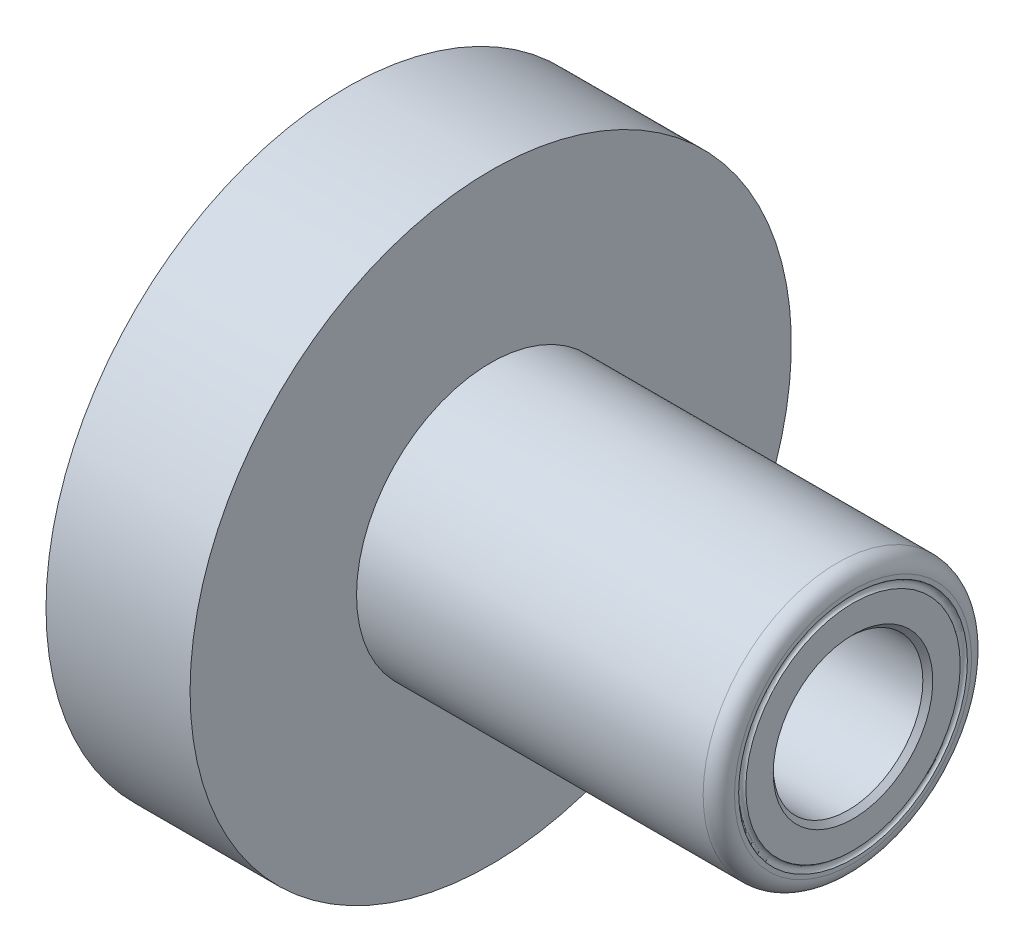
ISO-10303-21;
HEADER;
FILE_DESCRIPTION(('STEP AP214'),'2;1');
FILE_NAME('part.step','',(''),(''),'','','');
FILE_SCHEMA(('AUTOMOTIVE_DESIGN { 1 0 10303 214 1 1 1 1 }'));
ENDSEC;
DATA;
#1=APPLICATION_CONTEXT('core data for automotive mechanical design processes');
#2=APPLICATION_PROTOCOL_DEFINITION('international standard','automotive_design',2000,#1);
#3=PRODUCT_CONTEXT('',#1,'mechanical');
#4=PRODUCT('Part','Part','',(#3));
#5=PRODUCT_RELATED_PRODUCT_CATEGORY('part','',(#4));
#6=PRODUCT_DEFINITION_FORMATION('','',#4);
#7=PRODUCT_DEFINITION_CONTEXT('part definition',#1,'design');
#8=PRODUCT_DEFINITION('design','',#6,#7);
#9=PRODUCT_DEFINITION_SHAPE('','',#8);
#10=(LENGTH_UNIT() NAMED_UNIT(*) SI_UNIT(.MILLI.,.METRE.));
#11=(NAMED_UNIT(*) PLANE_ANGLE_UNIT() SI_UNIT($,.RADIAN.));
#12=(NAMED_UNIT(*) SI_UNIT($,.STERADIAN.) SOLID_ANGLE_UNIT());
#13=UNCERTAINTY_MEASURE_WITH_UNIT(LENGTH_MEASURE(1.E-05),#10,'distance_accuracy_value','');
#14=(GEOMETRIC_REPRESENTATION_CONTEXT(3) GLOBAL_UNCERTAINTY_ASSIGNED_CONTEXT((#13)) GLOBAL_UNIT_ASSIGNED_CONTEXT((#10,
#11,#12)) REPRESENTATION_CONTEXT('',''));
#15=CARTESIAN_POINT('',(0.,0.,0.));
#16=DIRECTION('',(0.,0.,1.));
#17=DIRECTION('',(1.,0.,0.));
#18=AXIS2_PLACEMENT_3D('',#15,#16,#17);
#19=CARTESIAN_POINT('',(50.8,11.8872,0.));
#20=DIRECTION('',(-1.,0.,0.));
#21=DIRECTION('',(0.,0.,1.));
#22=AXIS2_PLACEMENT_3D('',#19,#20,#21);
#23=PLANE('',#22);
#24=CARTESIAN_POINT('',(50.8,0.,0.));
#25=DIRECTION('',(-1.,0.,0.));
#26=DIRECTION('',(0.,0.,1.));
#27=AXIS2_PLACEMENT_3D('',#24,#25,#26);
#28=CIRCLE('',#27,11.8872);
#29=CARTESIAN_POINT('',(50.8,0.,11.8872));
#30=VERTEX_POINT('',#29);
#31=EDGE_CURVE('E87',#30,#30,#28,.T.);
#32=ORIENTED_EDGE('',*,*,#31,.F.);
#33=EDGE_LOOP('',(#32));
#34=FACE_BOUND('',#33,.T.);
#35=CARTESIAN_POINT('',(50.8,0.,0.));
#36=DIRECTION('',(-1.,0.,0.));
#37=DIRECTION('',(0.,0.,1.));
#38=AXIS2_PLACEMENT_3D('',#35,#36,#37);
#39=CIRCLE('',#38,11.4742102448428);
#40=CARTESIAN_POINT('',(50.8,0.,11.4742102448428));
#41=VERTEX_POINT('',#40);
#42=EDGE_CURVE('E35',#41,#41,#39,.F.);
#43=ORIENTED_EDGE('',*,*,#42,.F.);
#44=EDGE_LOOP('',(#43));
#45=FACE_BOUND('',#44,.T.);
#46=ADVANCED_FACE('F31',(#34,#45),#23,.F.);
#47=CARTESIAN_POINT('',(50.8,0.,0.));
#48=DIRECTION('',(-1.,0.,0.));
#49=DIRECTION('',(0.,0.,1.));
#50=AXIS2_PLACEMENT_3D('',#47,#48,#49);
#51=CIRCLE('',#50,8.00500000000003);
#52=CARTESIAN_POINT('',(50.8,0.,8.00500000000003));
#53=VERTEX_POINT('',#52);
#54=EDGE_CURVE('E10',#53,#53,#51,.T.);
#55=ORIENTED_EDGE('',*,*,#54,.T.);
#56=EDGE_LOOP('',(#55));
#57=FACE_BOUND('',#56,.T.);
#58=CARTESIAN_POINT('',(50.8,0.,0.));
#59=DIRECTION('',(1.,0.,0.));
#60=DIRECTION('',(0.,0.,-1.));
#61=AXIS2_PLACEMENT_3D('',#58,#59,#60);
#62=CIRCLE('',#61,10.7557897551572);
#63=CARTESIAN_POINT('',(50.8,0.,-10.7557897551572));
#64=VERTEX_POINT('',#63);
#65=EDGE_CURVE('E47',#64,#64,#62,.F.);
#66=ORIENTED_EDGE('',*,*,#65,.F.);
#67=EDGE_LOOP('',(#66));
#68=FACE_BOUND('',#67,.T.);
#69=ADVANCED_FACE('F97',(#57,#68),#23,.F.);
#70=CARTESIAN_POINT('',(0.,0.,0.));
#71=DIRECTION('',(-1.,0.,0.));
#72=DIRECTION('',(0.,0.,1.));
#73=AXIS2_PLACEMENT_3D('',#70,#71,#72);
#74=CYLINDRICAL_SURFACE('',#73,9.906);
#75=CARTESIAN_POINT('',(30.9372,0.,0.));
#76=DIRECTION('',(-1.,0.,0.));
#77=DIRECTION('',(0.,0.,1.));
#78=AXIS2_PLACEMENT_3D('',#75,#76,#77);
#79=CIRCLE('',#78,9.906);
#80=CARTESIAN_POINT('',(30.9372,0.,9.906));
#81=VERTEX_POINT('',#80);
#82=EDGE_CURVE('E44',#81,#81,#79,.T.);
#83=ORIENTED_EDGE('',*,*,#82,.F.);
#84=EDGE_LOOP('',(#83));
#85=FACE_BOUND('',#84,.T.);
#86=CARTESIAN_POINT('',(0.,0.,0.));
#87=DIRECTION('',(-1.,0.,0.));
#88=DIRECTION('',(0.,0.,1.));
#89=AXIS2_PLACEMENT_3D('',#86,#87,#88);
#90=CIRCLE('',#89,9.906);
#91=CARTESIAN_POINT('',(0.,0.,9.906));
#92=VERTEX_POINT('',#91);
#93=EDGE_CURVE('E70',#92,#92,#90,.T.);
#94=ORIENTED_EDGE('',*,*,#93,.T.);
#95=EDGE_LOOP('',(#94));
#96=FACE_BOUND('',#95,.T.);
#97=ADVANCED_FACE('F94',(#85,#96),#74,.F.);
#98=CARTESIAN_POINT('',(30.9372,9.906,0.));
#99=DIRECTION('',(1.,0.,0.));
#100=DIRECTION('',(0.,0.,-1.));
#101=AXIS2_PLACEMENT_3D('',#98,#99,#100);
#102=PLANE('',#101);
#103=CARTESIAN_POINT('',(30.9372,0.,0.));
#104=DIRECTION('',(1.,0.,0.));
#105=DIRECTION('',(0.,0.,-1.));
#106=AXIS2_PLACEMENT_3D('',#103,#104,#105);
#107=CIRCLE('',#106,7.505);
#108=CARTESIAN_POINT('',(30.9372,0.,-7.505));
#109=VERTEX_POINT('',#108);
#110=EDGE_CURVE('E52',#109,#109,#107,.T.);
#111=ORIENTED_EDGE('',*,*,#110,.T.);
#112=EDGE_LOOP('',(#111));
#113=FACE_BOUND('',#112,.T.);
#114=ORIENTED_EDGE('',*,*,#82,.T.);
#115=EDGE_LOOP('',(#114));
#116=FACE_BOUND('',#115,.T.);
#117=ADVANCED_FACE('F92',(#113,#116),#102,.F.);
#118=CARTESIAN_POINT('',(49.2252,0.,0.));
#119=DIRECTION('',(-1.,0.,0.));
#120=DIRECTION('',(0.,0.,1.));
#121=AXIS2_PLACEMENT_3D('',#118,#119,#120);
#122=TOROIDAL_SURFACE('',#121,11.8872,1.5748);
#123=CARTESIAN_POINT('',(49.2252,0.,0.));
#124=DIRECTION('',(-1.,0.,0.));
#125=DIRECTION('',(0.,0.,1.));
#126=AXIS2_PLACEMENT_3D('',#123,#124,#125);
#127=CIRCLE('',#126,13.462);
#128=CARTESIAN_POINT('',(49.2252,0.,13.462));
#129=VERTEX_POINT('',#128);
#130=EDGE_CURVE('E84',#129,#129,#127,.T.);
#131=ORIENTED_EDGE('',*,*,#130,.F.);
#132=EDGE_LOOP('',(#131));
#133=FACE_BOUND('',#132,.T.);
#134=ORIENTED_EDGE('',*,*,#31,.T.);
#135=EDGE_LOOP('',(#134));
#136=FACE_BOUND('',#135,.T.);
#137=ADVANCED_FACE('F123',(#133,#136),#122,.T.);
#138=CARTESIAN_POINT('',(0.,0.,0.));
#139=DIRECTION('',(-1.,0.,0.));
#140=DIRECTION('',(0.,0.,1.));
#141=AXIS2_PLACEMENT_3D('',#138,#139,#140);
#142=CYLINDRICAL_SURFACE('',#141,13.462);
#143=CARTESIAN_POINT('',(14.4526,0.,0.));
#144=DIRECTION('',(-1.,0.,0.));
#145=DIRECTION('',(0.,0.,1.));
#146=AXIS2_PLACEMENT_3D('',#143,#144,#145);
#147=CIRCLE('',#146,13.462);
#148=CARTESIAN_POINT('',(14.4526,0.,13.462));
#149=VERTEX_POINT('',#148);
#150=EDGE_CURVE('E81',#149,#149,#147,.T.);
#151=ORIENTED_EDGE('',*,*,#150,.F.);
#152=EDGE_LOOP('',(#151));
#153=FACE_BOUND('',#152,.T.);
#154=ORIENTED_EDGE('',*,*,#130,.T.);
#155=EDGE_LOOP('',(#154));
#156=FACE_BOUND('',#155,.T.);
#157=ADVANCED_FACE('F117',(#153,#156),#142,.T.);
#158=CARTESIAN_POINT('',(14.4526,30.1625,0.));
#159=DIRECTION('',(-1.,0.,0.));
#160=DIRECTION('',(0.,0.,1.));
#161=AXIS2_PLACEMENT_3D('',#158,#159,#160);
#162=PLANE('',#161);
#163=CARTESIAN_POINT('',(14.4526,0.,0.));
#164=DIRECTION('',(-1.,0.,0.));
#165=DIRECTION('',(0.,0.,1.));
#166=AXIS2_PLACEMENT_3D('',#163,#164,#165);
#167=CIRCLE('',#166,30.1625);
#168=CARTESIAN_POINT('',(14.4526,0.,30.1625));
#169=VERTEX_POINT('',#168);
#170=EDGE_CURVE('E78',#169,#169,#167,.T.);
#171=ORIENTED_EDGE('',*,*,#170,.F.);
#172=EDGE_LOOP('',(#171));
#173=FACE_BOUND('',#172,.T.);
#174=ORIENTED_EDGE('',*,*,#150,.T.);
#175=EDGE_LOOP('',(#174));
#176=FACE_BOUND('',#175,.T.);
#177=ADVANCED_FACE('F111',(#173,#176),#162,.F.);
#178=CARTESIAN_POINT('',(0.,0.,0.));
#179=DIRECTION('',(-1.,0.,0.));
#180=DIRECTION('',(0.,0.,1.));
#181=AXIS2_PLACEMENT_3D('',#178,#179,#180);
#182=CYLINDRICAL_SURFACE('',#181,30.1625);
#183=CARTESIAN_POINT('',(0.,0.,0.));
#184=DIRECTION('',(-1.,0.,0.));
#185=DIRECTION('',(0.,0.,1.));
#186=AXIS2_PLACEMENT_3D('',#183,#184,#185);
#187=CIRCLE('',#186,30.1625);
#188=CARTESIAN_POINT('',(0.,0.,30.1625));
#189=VERTEX_POINT('',#188);
#190=EDGE_CURVE('E75',#189,#189,#187,.T.);
#191=ORIENTED_EDGE('',*,*,#190,.F.);
#192=EDGE_LOOP('',(#191));
#193=FACE_BOUND('',#192,.T.);
#194=ORIENTED_EDGE('',*,*,#170,.T.);
#195=EDGE_LOOP('',(#194));
#196=FACE_BOUND('',#195,.T.);
#197=ADVANCED_FACE('F104',(#193,#196),#182,.T.);
#198=CARTESIAN_POINT('',(0.,9.906,0.));
#199=DIRECTION('',(1.,0.,0.));
#200=DIRECTION('',(0.,0.,-1.));
#201=AXIS2_PLACEMENT_3D('',#198,#199,#200);
#202=PLANE('',#201);
#203=CARTESIAN_POINT('',(0.,0.,19.939));
#204=DIRECTION('',(-1.,0.,0.));
#205=DIRECTION('',(0.,0.,-1.));
#206=AXIS2_PLACEMENT_3D('',#203,#204,#205);
#207=CIRCLE('',#206,3.2004);
#208=CARTESIAN_POINT('',(0.,0.,16.7386));
#209=VERTEX_POINT('',#208);
#210=EDGE_CURVE('E56',#209,#209,#207,.T.);
#211=ORIENTED_EDGE('',*,*,#210,.F.);
#212=EDGE_LOOP('',(#211));
#213=FACE_BOUND('',#212,.T.);
#214=CARTESIAN_POINT('',(0.,0.,-19.939));
#215=DIRECTION('',(-1.,0.,0.));
#216=DIRECTION('',(0.,0.,1.));
#217=AXIS2_PLACEMENT_3D('',#214,#215,#216);
#218=CIRCLE('',#217,3.2004);
#219=CARTESIAN_POINT('',(0.,0.,-16.7386));
#220=VERTEX_POINT('',#219);
#221=EDGE_CURVE('E65',#220,#220,#218,.T.);
#222=ORIENTED_EDGE('',*,*,#221,.F.);
#223=EDGE_LOOP('',(#222));
#224=FACE_BOUND('',#223,.T.);
#225=ORIENTED_EDGE('',*,*,#93,.F.);
#226=EDGE_LOOP('',(#225));
#227=FACE_BOUND('',#226,.T.);
#228=ORIENTED_EDGE('',*,*,#190,.T.);
#229=EDGE_LOOP('',(#228));
#230=FACE_BOUND('',#229,.T.);
#231=ADVANCED_FACE('F100',(#213,#224,#227,#230),#202,.F.);
#232=CARTESIAN_POINT('',(7.9502,0.,-19.939));
#233=DIRECTION('',(-1.,0.,0.));
#234=DIRECTION('',(0.,0.,1.));
#235=AXIS2_PLACEMENT_3D('',#232,#233,#234);
#236=CYLINDRICAL_SURFACE('',#235,3.2004);
#237=CARTESIAN_POINT('',(7.9502,0.,-19.939));
#238=DIRECTION('',(-1.,0.,0.));
#239=DIRECTION('',(0.,0.,1.));
#240=AXIS2_PLACEMENT_3D('',#237,#238,#239);
#241=CIRCLE('',#240,3.2004);
#242=CARTESIAN_POINT('',(7.9502,0.,-16.7386));
#243=VERTEX_POINT('',#242);
#244=EDGE_CURVE('E67',#243,#243,#241,.T.);
#245=ORIENTED_EDGE('',*,*,#244,.F.);
#246=EDGE_LOOP('',(#245));
#247=FACE_BOUND('',#246,.T.);
#248=ORIENTED_EDGE('',*,*,#221,.T.);
#249=EDGE_LOOP('',(#248));
#250=FACE_BOUND('',#249,.T.);
#251=ADVANCED_FACE('F103',(#247,#250),#236,.F.);
#252=CARTESIAN_POINT('',(7.9502,0.,-19.939));
#253=DIRECTION('',(-1.,0.,0.));
#254=DIRECTION('',(0.,0.,1.));
#255=AXIS2_PLACEMENT_3D('',#252,#253,#254);
#256=PLANE('',#255);
#257=ORIENTED_EDGE('',*,*,#244,.T.);
#258=EDGE_LOOP('',(#257));
#259=FACE_BOUND('',#258,.T.);
#260=ADVANCED_FACE('F172',(#259),#256,.T.);
#261=CARTESIAN_POINT('',(7.9502,0.,19.939));
#262=DIRECTION('',(-1.,0.,0.));
#263=DIRECTION('',(0.,0.,1.));
#264=AXIS2_PLACEMENT_3D('',#261,#262,#263);
#265=CYLINDRICAL_SURFACE('',#264,3.2004);
#266=CARTESIAN_POINT('',(7.9502,0.,19.939));
#267=DIRECTION('',(-1.,0.,0.));
#268=DIRECTION('',(0.,0.,-1.));
#269=AXIS2_PLACEMENT_3D('',#266,#267,#268);
#270=CIRCLE('',#269,3.2004);
#271=CARTESIAN_POINT('',(7.9502,0.,16.7386));
#272=VERTEX_POINT('',#271);
#273=EDGE_CURVE('E61',#272,#272,#270,.T.);
#274=ORIENTED_EDGE('',*,*,#273,.F.);
#275=EDGE_LOOP('',(#274));
#276=FACE_BOUND('',#275,.T.);
#277=ORIENTED_EDGE('',*,*,#210,.T.);
#278=EDGE_LOOP('',(#277));
#279=FACE_BOUND('',#278,.T.);
#280=ADVANCED_FACE('F180',(#276,#279),#265,.F.);
#281=CARTESIAN_POINT('',(7.9502,0.,19.939));
#282=DIRECTION('',(1.,0.,0.));
#283=DIRECTION('',(0.,0.,-1.));
#284=AXIS2_PLACEMENT_3D('',#281,#282,#283);
#285=PLANE('',#284);
#286=ORIENTED_EDGE('',*,*,#273,.T.);
#287=EDGE_LOOP('',(#286));
#288=FACE_BOUND('',#287,.T.);
#289=ADVANCED_FACE('F188',(#288),#285,.F.);
#290=CARTESIAN_POINT('',(0.,0.,0.));
#291=DIRECTION('',(1.,0.,0.));
#292=DIRECTION('',(0.,0.,-1.));
#293=AXIS2_PLACEMENT_3D('',#290,#291,#292);
#294=CYLINDRICAL_SURFACE('',#293,7.505);
#295=CARTESIAN_POINT('',(50.3,0.,0.));
#296=DIRECTION('',(-1.,0.,0.));
#297=DIRECTION('',(0.,0.,1.));
#298=AXIS2_PLACEMENT_3D('',#295,#296,#297);
#299=CIRCLE('',#298,7.505);
#300=CARTESIAN_POINT('',(50.3,0.,7.505));
#301=VERTEX_POINT('',#300);
#302=EDGE_CURVE('E39',#301,#301,#299,.F.);
#303=ORIENTED_EDGE('',*,*,#302,.T.);
#304=EDGE_LOOP('',(#303));
#305=FACE_BOUND('',#304,.T.);
#306=ORIENTED_EDGE('',*,*,#110,.F.);
#307=EDGE_LOOP('',(#306));
#308=FACE_BOUND('',#307,.T.);
#309=ADVANCED_FACE('F195',(#305,#308),#294,.F.);
#310=CARTESIAN_POINT('',(50.3,0.,0.));
#311=DIRECTION('',(1.,0.,0.));
#312=DIRECTION('',(0.,0.,-1.));
#313=AXIS2_PLACEMENT_3D('',#310,#311,#312);
#314=CONICAL_SURFACE('',#313,7.505,0.78539816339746);
#315=ORIENTED_EDGE('',*,*,#54,.F.);
#316=EDGE_LOOP('',(#315));
#317=FACE_BOUND('',#316,.T.);
#318=ORIENTED_EDGE('',*,*,#302,.F.);
#319=EDGE_LOOP('',(#318));
#320=FACE_BOUND('',#319,.T.);
#321=ADVANCED_FACE('F33',(#317,#320),#314,.F.);
#322=CARTESIAN_POINT('',(50.927,0.,0.));
#323=DIRECTION('',(-1.,0.,0.));
#324=DIRECTION('',(0.,0.,1.));
#325=AXIS2_PLACEMENT_3D('',#322,#323,#324);
#326=TOROIDAL_SURFACE('',#325,11.115,0.381000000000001);
#327=ORIENTED_EDGE('',*,*,#65,.T.);
#328=EDGE_LOOP('',(#327));
#329=FACE_BOUND('',#328,.T.);
#330=ORIENTED_EDGE('',*,*,#42,.T.);
#331=EDGE_LOOP('',(#330));
#332=FACE_BOUND('',#331,.T.);
#333=ADVANCED_FACE('F209',(#329,#332),#326,.F.);
#334=CLOSED_SHELL('',(#46,#69,#97,#117,#137,#157,#177,#197,#231,#251,#260,#280,#289,#309,#321,#333));
#335=MANIFOLD_SOLID_BREP('B2',#334);
#336=ADVANCED_BREP_SHAPE_REPRESENTATION('',(#18,#335),#14);
#337=SHAPE_DEFINITION_REPRESENTATION(#9,#336);
ENDSEC;
END-ISO-10303-21;
